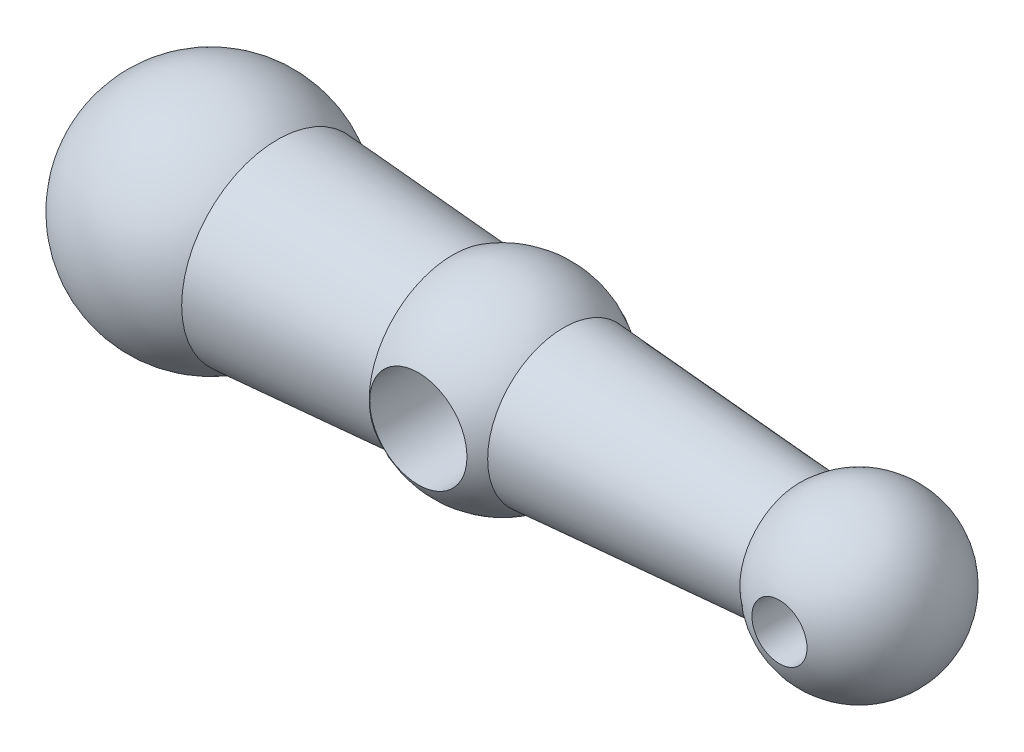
from build123d import *

# Parameters (mm, degrees)
SKETCH2_R                  = 7.5
CUT_EXTRUDE1_DEPTH         = 150
M10X1_5_TAPPED_HOLE1_D     = 8.5
M10X1_5_TAPPED_HOLE1_DEPTH = 10
M10X1_5_TAPPED_HOLE1_TIP   = 2.553657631


with BuildPart() as part:
    # Sketch1 → Revolve1 (revolve)
    with BuildSketch(Plane.XY):
        with BuildLine():
            ThreePointArc((-50, -18), (-32, 0), (-50, 18))
            Line((-50, 18), (-50, -18))
        make_face()
    revolve(axis=Axis((-50, 18, 0), (0, -1, 0)))



with BuildPart() as body_2:
    # Sketch1_3 → Revolve2 (revolve)
    with BuildSketch(Plane.XY):
        with BuildLine():
            Line((50, 8.503659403), (50, 0))
            Line((50, 0), (63, 0))
            ThreePointArc((63, 0), (59.192388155, 9.192388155), (50, 13))
            Line((50, 13), (50, 8.503659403))
        make_face()
        with BuildLine():
            Line((63, 0), (50, 0))
            Line((50, 0), (50, -13))
            ThreePointArc((50, -13), (59.192388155, -9.192388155), (63, 0))
        make_face()
        with BuildLine():
            Line((50, 8.503659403), (50, 0))
            Line((50, 0), (63, 0))
            ThreePointArc((63, 0), (59.192388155, 9.192388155), (50, 13))
            Line((50, 13), (50, 8.503659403))
        make_face()
        with BuildLine():
            Line((63, 0), (50, 0))
            Line((50, 0), (50, -13))
            ThreePointArc((50, -13), (59.192388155, -9.192388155), (63, 0))
        make_face()
    revolve(axis=Axis((50, 13, 0), (0, -1, 0)))


with BuildPart() as body_3:
    # Sketch1_4 → Revolve3 (revolve)
    with BuildSketch(Plane.XY):
        with BuildLine():
            ThreePointArc((-5, -15), (10, 0), (-5, 15))
            Line((-5, 15), (-5, -15))
        make_face()
    revolve(axis=Axis((-5, 15, 0), (0, -1, 0)))


with BuildPart() as part_1:
    add(part.part)

    add(body_2.part)  # Revolve4 merges body 2

    add(body_3.part)  # Revolve4 merges body 3
    # Sketch1_5 → Revolve4 (revolve)
    with BuildSketch(Plane.XY, mode=Mode.PRIVATE) as revolve4_sk:
        with BuildLine():
            ThreePointArc((-39.722850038, 14.777692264), (-34.04712096, 8.337004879), (-32, 0))
            Line((-32, 0), (-5, 0))
            Line((-5, 0), (-5, 12.34963406))
            Line((-5, 12.34963406), (-39.722850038, 14.777692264))
        make_face()
        with BuildLine():
            ThreePointArc((4.395897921, 11.692608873), (8.526612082, 6.483113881), (10, 0))
            Line((10, 0), (50, 0))
            Line((50, 0), (50, 8.503659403))
            Line((50, 8.503659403), (4.395897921, 11.692608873))
        make_face()
    revolve(revolve4_sk.sketch.rotate(Axis((-66.951037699, 0, 0), (1, 0, 0)), 90), axis=Axis((-66.951037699, 0, 0), (1, 0, 0)))

    # Sketch2 → Cut-Extrude1 (cut, symmetric)
    with BuildSketch(Plane.XY):
        with Locations((-5, 0)):
            Circle(SKETCH2_R)
    extrude(amount=CUT_EXTRUDE1_DEPTH, both=True, mode=Mode.SUBTRACT)

    # M10x1.5 Tapped Hole1
    with Locations(Plane.XY.offset(13)):
        with Locations((50, 0)):
            Hole(M10X1_5_TAPPED_HOLE1_D / 2, depth=M10X1_5_TAPPED_HOLE1_DEPTH)
            with Locations((0, 0, -(M10X1_5_TAPPED_HOLE1_DEPTH + M10X1_5_TAPPED_HOLE1_TIP / 2))):  # 118° drill point
                Cone(0, M10X1_5_TAPPED_HOLE1_D / 2, M10X1_5_TAPPED_HOLE1_TIP, mode=Mode.SUBTRACT)


solid = part_1.part
